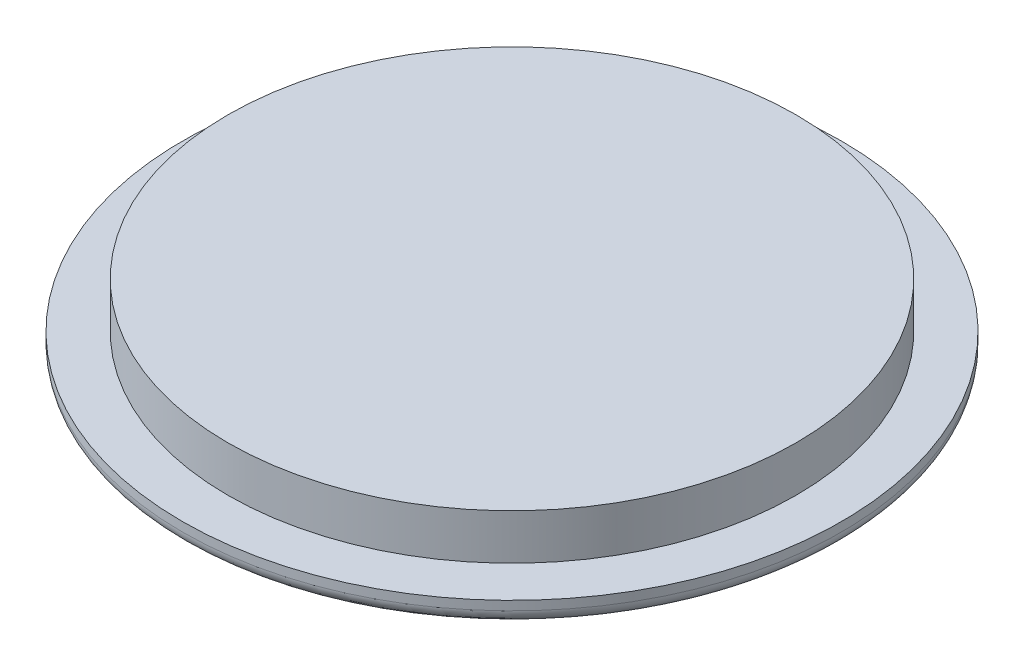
from build123d import *

# Parameters (mm, degrees)
CONG_1_R = 3


with BuildPart() as part:
    # Esquisse2 → R_volution1 (revolve)
    with BuildSketch(Plane.XY, mode=Mode.PRIVATE) as r_volution1_sk:
        Polygon((0, 0), (-72.5, 0), (-72.5, 5), (-62.5, 5), (-62.5, 15), (0, 15), align=None)
    revolve(r_volution1_sk.sketch.rotate(Axis((0, 55, 0), (0, -1, 0)), 270), axis=Axis((0, 55, 0), (0, -1, 0)))

    # Cong_1
    cong_1_edges = [part.edges().sort_by_distance(p)[0] for p in [
        (0, 0, -72.5),
    ]]
    fillet(cong_1_edges, radius=CONG_1_R)


solid = part.part
